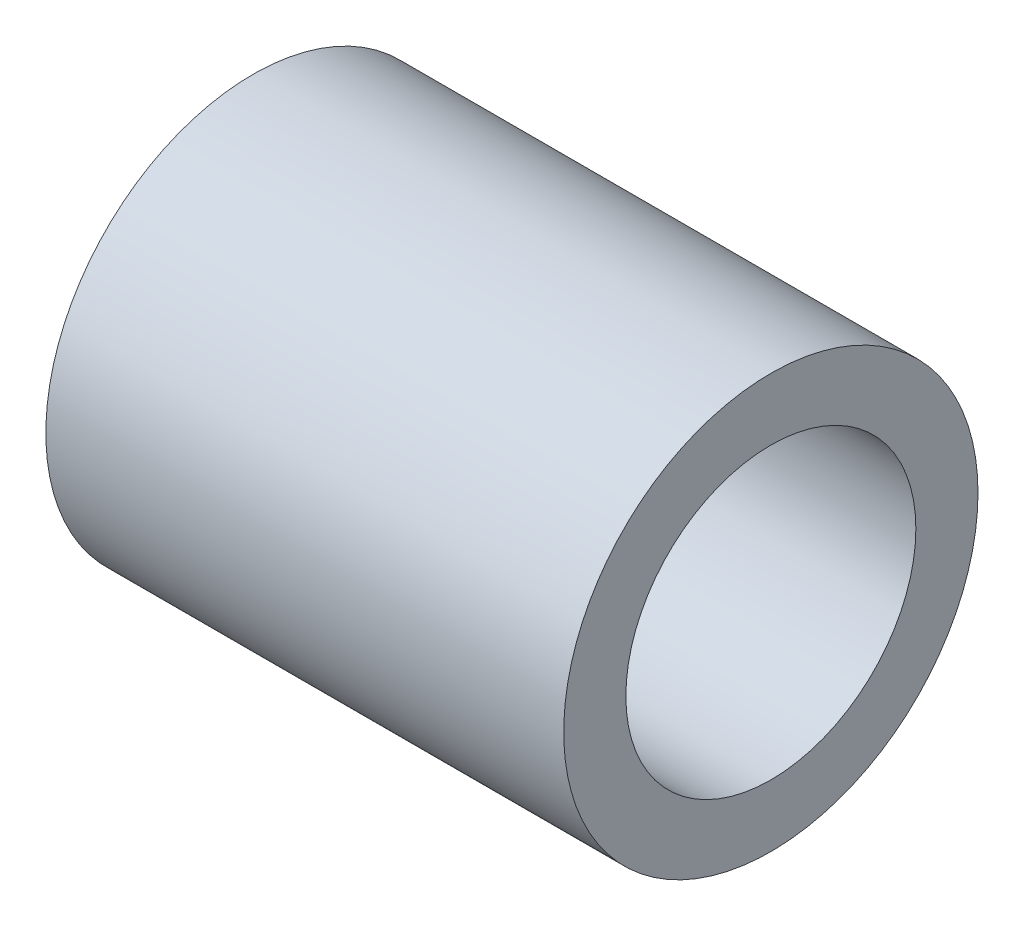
ISO-10303-21;
HEADER;
FILE_DESCRIPTION(('STEP AP214'),'2;1');
FILE_NAME('part.step','',(''),(''),'','','');
FILE_SCHEMA(('AUTOMOTIVE_DESIGN { 1 0 10303 214 1 1 1 1 }'));
ENDSEC;
DATA;
#1=APPLICATION_CONTEXT('core data for automotive mechanical design processes');
#2=APPLICATION_PROTOCOL_DEFINITION('international standard','automotive_design',2000,#1);
#3=PRODUCT_CONTEXT('',#1,'mechanical');
#4=PRODUCT('Part','Part','',(#3));
#5=PRODUCT_RELATED_PRODUCT_CATEGORY('part','',(#4));
#6=PRODUCT_DEFINITION_FORMATION('','',#4);
#7=PRODUCT_DEFINITION_CONTEXT('part definition',#1,'design');
#8=PRODUCT_DEFINITION('design','',#6,#7);
#9=PRODUCT_DEFINITION_SHAPE('','',#8);
#10=(LENGTH_UNIT() NAMED_UNIT(*) SI_UNIT(.MILLI.,.METRE.));
#11=(NAMED_UNIT(*) PLANE_ANGLE_UNIT() SI_UNIT($,.RADIAN.));
#12=(NAMED_UNIT(*) SI_UNIT($,.STERADIAN.) SOLID_ANGLE_UNIT());
#13=UNCERTAINTY_MEASURE_WITH_UNIT(LENGTH_MEASURE(1.E-05),#10,'distance_accuracy_value','');
#14=(GEOMETRIC_REPRESENTATION_CONTEXT(3) GLOBAL_UNCERTAINTY_ASSIGNED_CONTEXT((#13)) GLOBAL_UNIT_ASSIGNED_CONTEXT((#10,
#11,#12)) REPRESENTATION_CONTEXT('',''));
#15=CARTESIAN_POINT('',(0.,0.,0.));
#16=DIRECTION('',(0.,0.,1.));
#17=DIRECTION('',(1.,0.,0.));
#18=AXIS2_PLACEMENT_3D('',#15,#16,#17);
#19=CARTESIAN_POINT('',(0.,0.,-7.));
#20=DIRECTION('',(1.,0.,0.));
#21=DIRECTION('',(0.,0.,-1.));
#22=AXIS2_PLACEMENT_3D('',#19,#20,#21);
#23=PLANE('',#22);
#24=CARTESIAN_POINT('',(0.,0.,0.));
#25=DIRECTION('',(1.,0.,0.));
#26=DIRECTION('',(0.,0.,-1.));
#27=AXIS2_PLACEMENT_3D('',#24,#25,#26);
#28=CIRCLE('',#27,10.);
#29=CARTESIAN_POINT('',(0.,0.,-10.));
#30=VERTEX_POINT('',#29);
#31=EDGE_CURVE('E39',#30,#30,#28,.T.);
#32=ORIENTED_EDGE('',*,*,#31,.T.);
#33=EDGE_LOOP('',(#32));
#34=FACE_BOUND('',#33,.T.);
#35=CARTESIAN_POINT('',(0.,0.,0.));
#36=DIRECTION('',(1.,0.,0.));
#37=DIRECTION('',(0.,0.,-1.));
#38=AXIS2_PLACEMENT_3D('',#35,#36,#37);
#39=CIRCLE('',#38,7.);
#40=CARTESIAN_POINT('',(0.,0.,-7.));
#41=VERTEX_POINT('',#40);
#42=EDGE_CURVE('E54',#41,#41,#39,.T.);
#43=ORIENTED_EDGE('',*,*,#42,.F.);
#44=EDGE_LOOP('',(#43));
#45=FACE_BOUND('',#44,.T.);
#46=ADVANCED_FACE('F28',(#34,#45),#23,.T.);
#47=CARTESIAN_POINT('',(0.,0.,0.));
#48=DIRECTION('',(1.,0.,0.));
#49=DIRECTION('',(0.,0.,-1.));
#50=AXIS2_PLACEMENT_3D('',#47,#48,#49);
#51=CYLINDRICAL_SURFACE('',#50,10.);
#52=CARTESIAN_POINT('',(-25.,0.,0.));
#53=DIRECTION('',(1.,0.,0.));
#54=DIRECTION('',(0.,0.,-1.));
#55=AXIS2_PLACEMENT_3D('',#52,#53,#54);
#56=CIRCLE('',#55,10.);
#57=CARTESIAN_POINT('',(-25.,0.,-10.));
#58=VERTEX_POINT('',#57);
#59=EDGE_CURVE('E43',#58,#58,#56,.T.);
#60=ORIENTED_EDGE('',*,*,#59,.T.);
#61=EDGE_LOOP('',(#60));
#62=FACE_BOUND('',#61,.T.);
#63=ORIENTED_EDGE('',*,*,#31,.F.);
#64=EDGE_LOOP('',(#63));
#65=FACE_BOUND('',#64,.T.);
#66=ADVANCED_FACE('F62',(#62,#65),#51,.T.);
#67=CARTESIAN_POINT('',(-25.,0.,-10.));
#68=DIRECTION('',(-1.,0.,0.));
#69=DIRECTION('',(0.,0.,1.));
#70=AXIS2_PLACEMENT_3D('',#67,#68,#69);
#71=PLANE('',#70);
#72=CARTESIAN_POINT('',(-25.,0.,0.));
#73=DIRECTION('',(1.,0.,0.));
#74=DIRECTION('',(0.,0.,-1.));
#75=AXIS2_PLACEMENT_3D('',#72,#73,#74);
#76=CIRCLE('',#75,4.25);
#77=CARTESIAN_POINT('',(-25.,0.,-4.25));
#78=VERTEX_POINT('',#77);
#79=EDGE_CURVE('E48',#78,#78,#76,.T.);
#80=ORIENTED_EDGE('',*,*,#79,.T.);
#81=EDGE_LOOP('',(#80));
#82=FACE_BOUND('',#81,.T.);
#83=ORIENTED_EDGE('',*,*,#59,.F.);
#84=EDGE_LOOP('',(#83));
#85=FACE_BOUND('',#84,.T.);
#86=ADVANCED_FACE('F67',(#82,#85),#71,.T.);
#87=CARTESIAN_POINT('',(0.,0.,0.));
#88=DIRECTION('',(1.,0.,0.));
#89=DIRECTION('',(0.,0.,-1.));
#90=AXIS2_PLACEMENT_3D('',#87,#88,#89);
#91=CYLINDRICAL_SURFACE('',#90,4.25);
#92=CARTESIAN_POINT('',(-15.5,0.,0.));
#93=DIRECTION('',(1.,0.,0.));
#94=DIRECTION('',(0.,0.,-1.));
#95=AXIS2_PLACEMENT_3D('',#92,#93,#94);
#96=CIRCLE('',#95,4.25);
#97=CARTESIAN_POINT('',(-15.5,0.,-4.25));
#98=VERTEX_POINT('',#97);
#99=EDGE_CURVE('E35',#98,#98,#96,.T.);
#100=ORIENTED_EDGE('',*,*,#99,.T.);
#101=EDGE_LOOP('',(#100));
#102=FACE_BOUND('',#101,.T.);
#103=ORIENTED_EDGE('',*,*,#79,.F.);
#104=EDGE_LOOP('',(#103));
#105=FACE_BOUND('',#104,.T.);
#106=ADVANCED_FACE('F73',(#102,#105),#91,.F.);
#107=CARTESIAN_POINT('',(-15.,0.,-4.25));
#108=DIRECTION('',(1.,0.,0.));
#109=DIRECTION('',(0.,0.,-1.));
#110=AXIS2_PLACEMENT_3D('',#107,#108,#109);
#111=PLANE('',#110);
#112=CARTESIAN_POINT('',(-15.,0.,0.));
#113=DIRECTION('',(1.,0.,0.));
#114=DIRECTION('',(0.,0.,-1.));
#115=AXIS2_PLACEMENT_3D('',#112,#113,#114);
#116=CIRCLE('',#115,4.75000000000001);
#117=CARTESIAN_POINT('',(-15.,0.,-4.75000000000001));
#118=VERTEX_POINT('',#117);
#119=EDGE_CURVE('E10',#118,#118,#116,.F.);
#120=ORIENTED_EDGE('',*,*,#119,.T.);
#121=EDGE_LOOP('',(#120));
#122=FACE_BOUND('',#121,.T.);
#123=CARTESIAN_POINT('',(-15.,0.,0.));
#124=DIRECTION('',(1.,0.,0.));
#125=DIRECTION('',(0.,0.,-1.));
#126=AXIS2_PLACEMENT_3D('',#123,#124,#125);
#127=CIRCLE('',#126,7.);
#128=CARTESIAN_POINT('',(-15.,0.,-7.));
#129=VERTEX_POINT('',#128);
#130=EDGE_CURVE('E51',#129,#129,#127,.T.);
#131=ORIENTED_EDGE('',*,*,#130,.T.);
#132=EDGE_LOOP('',(#131));
#133=FACE_BOUND('',#132,.T.);
#134=ADVANCED_FACE('F77',(#122,#133),#111,.T.);
#135=CARTESIAN_POINT('',(0.,0.,0.));
#136=DIRECTION('',(1.,0.,0.));
#137=DIRECTION('',(0.,0.,-1.));
#138=AXIS2_PLACEMENT_3D('',#135,#136,#137);
#139=CYLINDRICAL_SURFACE('',#138,7.);
#140=ORIENTED_EDGE('',*,*,#42,.T.);
#141=EDGE_LOOP('',(#140));
#142=FACE_BOUND('',#141,.T.);
#143=ORIENTED_EDGE('',*,*,#130,.F.);
#144=EDGE_LOOP('',(#143));
#145=FACE_BOUND('',#144,.T.);
#146=ADVANCED_FACE('F58',(#142,#145),#139,.F.);
#147=CARTESIAN_POINT('',(-15.5,0.,0.));
#148=DIRECTION('',(1.,0.,0.));
#149=DIRECTION('',(0.,0.,-1.));
#150=AXIS2_PLACEMENT_3D('',#147,#148,#149);
#151=CONICAL_SURFACE('',#150,4.25,0.785398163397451);
#152=ORIENTED_EDGE('',*,*,#119,.F.);
#153=EDGE_LOOP('',(#152));
#154=FACE_BOUND('',#153,.T.);
#155=ORIENTED_EDGE('',*,*,#99,.F.);
#156=EDGE_LOOP('',(#155));
#157=FACE_BOUND('',#156,.T.);
#158=ADVANCED_FACE('F30',(#154,#157),#151,.F.);
#159=CLOSED_SHELL('',(#46,#66,#86,#106,#134,#146,#158));
#160=MANIFOLD_SOLID_BREP('B2',#159);
#161=ADVANCED_BREP_SHAPE_REPRESENTATION('',(#18,#160),#14);
#162=SHAPE_DEFINITION_REPRESENTATION(#9,#161);
ENDSEC;
END-ISO-10303-21;
